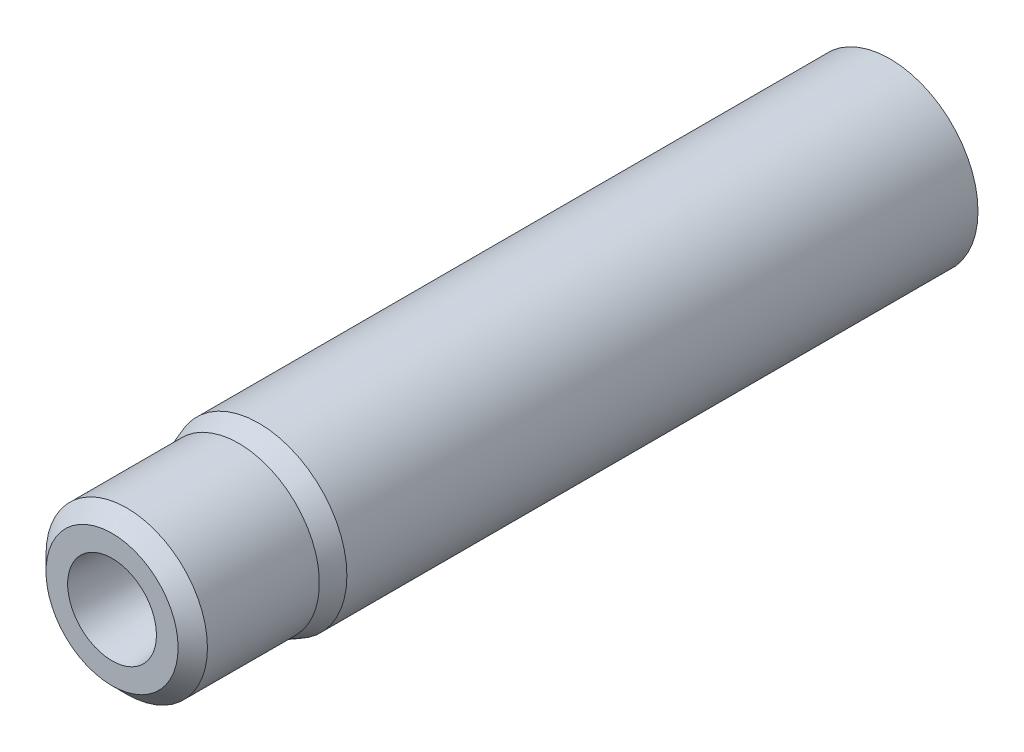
ISO-10303-21;
HEADER;
FILE_DESCRIPTION(('STEP AP214'),'2;1');
FILE_NAME('part.step','',(''),(''),'','','');
FILE_SCHEMA(('AUTOMOTIVE_DESIGN { 1 0 10303 214 1 1 1 1 }'));
ENDSEC;
DATA;
#1=APPLICATION_CONTEXT('core data for automotive mechanical design processes');
#2=APPLICATION_PROTOCOL_DEFINITION('international standard','automotive_design',2000,#1);
#3=PRODUCT_CONTEXT('',#1,'mechanical');
#4=PRODUCT('Part','Part','',(#3));
#5=PRODUCT_RELATED_PRODUCT_CATEGORY('part','',(#4));
#6=PRODUCT_DEFINITION_FORMATION('','',#4);
#7=PRODUCT_DEFINITION_CONTEXT('part definition',#1,'design');
#8=PRODUCT_DEFINITION('design','',#6,#7);
#9=PRODUCT_DEFINITION_SHAPE('','',#8);
#10=(LENGTH_UNIT() NAMED_UNIT(*) SI_UNIT(.MILLI.,.METRE.));
#11=(NAMED_UNIT(*) PLANE_ANGLE_UNIT() SI_UNIT($,.RADIAN.));
#12=(NAMED_UNIT(*) SI_UNIT($,.STERADIAN.) SOLID_ANGLE_UNIT());
#13=UNCERTAINTY_MEASURE_WITH_UNIT(LENGTH_MEASURE(1.E-05),#10,'distance_accuracy_value','');
#14=(GEOMETRIC_REPRESENTATION_CONTEXT(3) GLOBAL_UNCERTAINTY_ASSIGNED_CONTEXT((#13)) GLOBAL_UNIT_ASSIGNED_CONTEXT((#10,
#11,#12)) REPRESENTATION_CONTEXT('',''));
#15=CARTESIAN_POINT('',(0.,0.,0.));
#16=DIRECTION('',(0.,0.,1.));
#17=DIRECTION('',(1.,0.,0.));
#18=AXIS2_PLACEMENT_3D('',#15,#16,#17);
#19=CARTESIAN_POINT('',(0.,0.,45.));
#20=DIRECTION('',(0.,0.,-1.));
#21=DIRECTION('',(-1.,0.,0.));
#22=AXIS2_PLACEMENT_3D('',#19,#20,#21);
#23=CYLINDRICAL_SURFACE('',#22,6.);
#24=CARTESIAN_POINT('',(0.,0.,43.));
#25=DIRECTION('',(0.,0.,1.));
#26=DIRECTION('',(1.,0.,0.));
#27=AXIS2_PLACEMENT_3D('',#24,#25,#26);
#28=CIRCLE('',#27,6.);
#29=CARTESIAN_POINT('',(-6.,0.,43.));
#30=VERTEX_POINT('',#29);
#31=EDGE_CURVE('E57',#30,#30,#28,.F.);
#32=CARTESIAN_POINT('',(0.,0.,0.));
#33=DIRECTION('',(0.,0.,1.));
#34=DIRECTION('',(1.,0.,0.));
#35=AXIS2_PLACEMENT_3D('',#32,#33,#34);
#36=CIRCLE('',#35,6.);
#37=CARTESIAN_POINT('',(-6.,0.,0.));
#38=VERTEX_POINT('',#37);
#39=EDGE_CURVE('E53',#38,#38,#36,.T.);
#40=CARTESIAN_POINT('',(-6.,0.,43.));
#41=CARTESIAN_POINT('',(-6.,0.,42.5520833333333));
#42=CARTESIAN_POINT('',(-6.,0.,42.1041666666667));
#43=CARTESIAN_POINT('',(-6.,0.,41.2083333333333));
#44=CARTESIAN_POINT('',(-6.,0.,40.7604166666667));
#45=CARTESIAN_POINT('',(-6.,0.,39.8645833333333));
#46=CARTESIAN_POINT('',(-6.,0.,39.4166666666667));
#47=CARTESIAN_POINT('',(-6.,0.,38.5208333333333));
#48=CARTESIAN_POINT('',(-6.,0.,38.0729166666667));
#49=CARTESIAN_POINT('',(-6.,0.,37.1770833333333));
#50=CARTESIAN_POINT('',(-6.,0.,36.7291666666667));
#51=CARTESIAN_POINT('',(-6.,0.,35.8333333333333));
#52=CARTESIAN_POINT('',(-6.,0.,35.3854166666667));
#53=CARTESIAN_POINT('',(-6.,0.,34.4895833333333));
#54=CARTESIAN_POINT('',(-6.,0.,34.0416666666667));
#55=CARTESIAN_POINT('',(-6.,0.,33.1458333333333));
#56=CARTESIAN_POINT('',(-6.,0.,32.6979166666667));
#57=CARTESIAN_POINT('',(-6.,0.,31.8020833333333));
#58=CARTESIAN_POINT('',(-6.,0.,31.3541666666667));
#59=CARTESIAN_POINT('',(-6.,0.,30.4583333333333));
#60=CARTESIAN_POINT('',(-6.,0.,30.0104166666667));
#61=CARTESIAN_POINT('',(-6.,0.,29.1145833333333));
#62=CARTESIAN_POINT('',(-6.,0.,28.6666666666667));
#63=CARTESIAN_POINT('',(-6.,0.,27.7708333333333));
#64=CARTESIAN_POINT('',(-6.,0.,27.3229166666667));
#65=CARTESIAN_POINT('',(-6.,0.,26.4270833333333));
#66=CARTESIAN_POINT('',(-6.,0.,25.9791666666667));
#67=CARTESIAN_POINT('',(-6.,0.,25.0833333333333));
#68=CARTESIAN_POINT('',(-6.,0.,24.6354166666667));
#69=CARTESIAN_POINT('',(-6.,0.,23.7395833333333));
#70=CARTESIAN_POINT('',(-6.,0.,23.2916666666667));
#71=CARTESIAN_POINT('',(-6.,0.,22.3958333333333));
#72=CARTESIAN_POINT('',(-6.,0.,21.9479166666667));
#73=CARTESIAN_POINT('',(-6.,0.,21.0520833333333));
#74=CARTESIAN_POINT('',(-6.,0.,20.6041666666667));
#75=CARTESIAN_POINT('',(-6.,0.,19.7083333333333));
#76=CARTESIAN_POINT('',(-6.,0.,19.2604166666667));
#77=CARTESIAN_POINT('',(-6.,0.,18.3645833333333));
#78=CARTESIAN_POINT('',(-6.,0.,17.9166666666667));
#79=CARTESIAN_POINT('',(-6.,0.,17.0208333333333));
#80=CARTESIAN_POINT('',(-6.,0.,16.5729166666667));
#81=CARTESIAN_POINT('',(-6.,0.,15.6770833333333));
#82=CARTESIAN_POINT('',(-6.,0.,15.2291666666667));
#83=CARTESIAN_POINT('',(-6.,0.,14.3333333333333));
#84=CARTESIAN_POINT('',(-6.,0.,13.8854166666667));
#85=CARTESIAN_POINT('',(-6.,0.,12.9895833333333));
#86=CARTESIAN_POINT('',(-6.,0.,12.5416666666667));
#87=CARTESIAN_POINT('',(-6.,0.,11.6458333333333));
#88=CARTESIAN_POINT('',(-6.,0.,11.1979166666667));
#89=CARTESIAN_POINT('',(-6.,0.,10.3020833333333));
#90=CARTESIAN_POINT('',(-6.,0.,9.85416666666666));
#91=CARTESIAN_POINT('',(-6.,0.,8.95833333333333));
#92=CARTESIAN_POINT('',(-6.,0.,8.51041666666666));
#93=CARTESIAN_POINT('',(-6.,0.,7.61458333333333));
#94=CARTESIAN_POINT('',(-6.,0.,7.16666666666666));
#95=CARTESIAN_POINT('',(-6.,0.,6.27083333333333));
#96=CARTESIAN_POINT('',(-6.,0.,5.82291666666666));
#97=CARTESIAN_POINT('',(-6.,0.,4.92708333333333));
#98=CARTESIAN_POINT('',(-6.,0.,4.47916666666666));
#99=CARTESIAN_POINT('',(-6.,0.,3.58333333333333));
#100=CARTESIAN_POINT('',(-6.,0.,3.13541666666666));
#101=CARTESIAN_POINT('',(-6.,0.,2.23958333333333));
#102=CARTESIAN_POINT('',(-6.,0.,1.79166666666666));
#103=CARTESIAN_POINT('',(-6.,0.,0.895833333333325));
#104=CARTESIAN_POINT('',(-6.,0.,0.447916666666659));
#105=CARTESIAN_POINT('',(-6.,0.,0.));
#106=B_SPLINE_CURVE_WITH_KNOTS('',3,(#40,#41,#42,#43,#44,#45,#46,#47,#48,#49,#50,#51,#52,#53,
#54,#55,#56,#57,#58,#59,#60,#61,#62,#63,#64,#65,#66,#67,#68,#69,#70,#71,#72,#73,#74,#75,#76,#77,
#78,#79,#80,#81,#82,#83,#84,#85,#86,#87,#88,#89,#90,#91,#92,#93,#94,#95,#96,#97,#98,#99,#100,
#101,#102,#103,#104,#105),.UNSPECIFIED.,.F.,.F.,(4,2,2,2,2,2,2,2,2,2,2,2,2,2,2,2,2,2,2,2,2,2,2,
2,2,2,2,2,2,2,2,2,4),(0.,1.34375,2.6875,4.03124999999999,5.375,6.71875,8.06249999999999,9.40625,
10.75,12.09375,13.4375,14.78125,16.125,17.46875,18.8125,20.15625,21.5,22.84375,24.1875,25.53125,
26.875,28.21875,29.5625,30.90625,32.25,33.59375,34.9375,36.28125,37.625,38.96875,40.3125,
41.65625,43.),.UNSPECIFIED.);
#107=EDGE_CURVE('BSEAM33',#30,#38,#106,.T.);
#108=ORIENTED_EDGE('',*,*,#31,.T.);
#109=ORIENTED_EDGE('',*,*,#39,.T.);
#110=ORIENTED_EDGE('',*,*,#107,.T.);
#111=ORIENTED_EDGE('',*,*,#107,.F.);
#112=EDGE_LOOP('',(#108,#110,#109,#111));
#113=FACE_BOUND('',#112,.T.);
#114=ADVANCED_FACE('F33',(#113),#23,.T.);
#115=CARTESIAN_POINT('',(0.,0.,0.));
#116=DIRECTION('',(0.,0.,1.));
#117=DIRECTION('',(1.,0.,0.));
#118=AXIS2_PLACEMENT_3D('',#115,#116,#117);
#119=PLANE('',#118);
#120=ORIENTED_EDGE('',*,*,#39,.F.);
#121=EDGE_LOOP('',(#120));
#122=FACE_BOUND('',#121,.T.);
#123=ADVANCED_FACE('F83',(#122),#119,.F.);
#124=CARTESIAN_POINT('',(0.,0.,53.));
#125=DIRECTION('',(0.,0.,-1.));
#126=DIRECTION('',(-1.,0.,0.));
#127=AXIS2_PLACEMENT_3D('',#124,#125,#126);
#128=CYLINDRICAL_SURFACE('',#127,5.5);
#129=CARTESIAN_POINT('',(0.,0.,52.));
#130=DIRECTION('',(0.,0.,1.));
#131=DIRECTION('',(1.,0.,0.));
#132=AXIS2_PLACEMENT_3D('',#129,#130,#131);
#133=CIRCLE('',#132,5.5);
#134=CARTESIAN_POINT('',(5.5,0.,52.));
#135=VERTEX_POINT('',#134);
#136=EDGE_CURVE('E11',#135,#135,#133,.F.);
#137=ORIENTED_EDGE('',*,*,#136,.T.);
#138=EDGE_LOOP('',(#137));
#139=FACE_BOUND('',#138,.T.);
#140=CARTESIAN_POINT('',(0.,0.,44.3737387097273));
#141=DIRECTION('',(0.,0.,-1.));
#142=DIRECTION('',(-1.,0.,0.));
#143=AXIS2_PLACEMENT_3D('',#140,#141,#142);
#144=CIRCLE('',#143,5.5);
#145=CARTESIAN_POINT('',(-5.5,0.,44.3737387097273));
#146=VERTEX_POINT('',#145);
#147=EDGE_CURVE('E66',#146,#146,#144,.F.);
#148=ORIENTED_EDGE('',*,*,#147,.T.);
#149=EDGE_LOOP('',(#148));
#150=FACE_BOUND('',#149,.T.);
#151=ADVANCED_FACE('F89',(#139,#150),#128,.T.);
#152=CARTESIAN_POINT('',(0.,0.,53.));
#153=DIRECTION('',(0.,0.,1.));
#154=DIRECTION('',(1.,0.,0.));
#155=AXIS2_PLACEMENT_3D('',#152,#153,#154);
#156=PLANE('',#155);
#157=CARTESIAN_POINT('',(0.,0.,53.));
#158=DIRECTION('',(0.,0.,1.));
#159=DIRECTION('',(1.,0.,0.));
#160=AXIS2_PLACEMENT_3D('',#157,#158,#159);
#161=CIRCLE('',#160,4.5);
#162=CARTESIAN_POINT('',(4.5,0.,53.));
#163=VERTEX_POINT('',#162);
#164=EDGE_CURVE('E40',#163,#163,#161,.T.);
#165=ORIENTED_EDGE('',*,*,#164,.T.);
#166=EDGE_LOOP('',(#165));
#167=FACE_BOUND('',#166,.T.);
#168=CARTESIAN_POINT('',(0.,0.,53.));
#169=DIRECTION('',(0.,0.,1.));
#170=DIRECTION('',(1.,0.,0.));
#171=AXIS2_PLACEMENT_3D('',#168,#169,#170);
#172=CIRCLE('',#171,3.025);
#173=CARTESIAN_POINT('',(3.025,0.,53.));
#174=VERTEX_POINT('',#173);
#175=EDGE_CURVE('E60',#174,#174,#172,.T.);
#176=ORIENTED_EDGE('',*,*,#175,.F.);
#177=EDGE_LOOP('',(#176));
#178=FACE_BOUND('',#177,.T.);
#179=ADVANCED_FACE('F47',(#167,#178),#156,.T.);
#180=CARTESIAN_POINT('',(0.,0.,38.));
#181=DIRECTION('',(0.,0.,1.));
#182=DIRECTION('',(1.,0.,0.));
#183=AXIS2_PLACEMENT_3D('',#180,#181,#182);
#184=CONICAL_SURFACE('',#183,2.5,1.02974425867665);
#185=CARTESIAN_POINT('',(0.,0.,36.4978484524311));
#186=VERTEX_POINT('',#185);
#187=VERTEX_LOOP('',#186);
#188=FACE_BOUND('',#187,.T.);
#189=CARTESIAN_POINT('',(0.,0.,38.));
#190=DIRECTION('',(0.,0.,1.));
#191=DIRECTION('',(1.,0.,0.));
#192=AXIS2_PLACEMENT_3D('',#189,#190,#191);
#193=CIRCLE('',#192,2.5);
#194=CARTESIAN_POINT('',(2.5,0.,38.));
#195=VERTEX_POINT('',#194);
#196=EDGE_CURVE('E51',#195,#195,#193,.T.);
#197=ORIENTED_EDGE('',*,*,#196,.T.);
#198=EDGE_LOOP('',(#197));
#199=FACE_BOUND('',#198,.T.);
#200=ADVANCED_FACE('F43',(#188,#199),#184,.F.);
#201=CARTESIAN_POINT('',(0.,0.,53.));
#202=DIRECTION('',(0.,0.,1.));
#203=DIRECTION('',(1.,0.,0.));
#204=AXIS2_PLACEMENT_3D('',#201,#202,#203);
#205=CYLINDRICAL_SURFACE('',#204,2.5);
#206=ORIENTED_EDGE('',*,*,#196,.F.);
#207=EDGE_LOOP('',(#206));
#208=FACE_BOUND('',#207,.T.);
#209=CARTESIAN_POINT('',(0.,0.,48.0049586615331));
#210=DIRECTION('',(0.,0.,1.));
#211=DIRECTION('',(1.,0.,0.));
#212=AXIS2_PLACEMENT_3D('',#209,#210,#211);
#213=CIRCLE('',#212,2.5);
#214=CARTESIAN_POINT('',(2.5,0.,48.0049586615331));
#215=VERTEX_POINT('',#214);
#216=EDGE_CURVE('E54',#215,#215,#213,.T.);
#217=ORIENTED_EDGE('',*,*,#216,.T.);
#218=EDGE_LOOP('',(#217));
#219=FACE_BOUND('',#218,.T.);
#220=ADVANCED_FACE('F46',(#208,#219),#205,.F.);
#221=CARTESIAN_POINT('',(0.,0.,53.));
#222=DIRECTION('',(0.,0.,1.));
#223=DIRECTION('',(1.,0.,0.));
#224=AXIS2_PLACEMENT_3D('',#221,#222,#223);
#225=CONICAL_SURFACE('',#224,3.025,0.10471975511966);
#226=ORIENTED_EDGE('',*,*,#216,.F.);
#227=EDGE_LOOP('',(#226));
#228=FACE_BOUND('',#227,.T.);
#229=ORIENTED_EDGE('',*,*,#175,.T.);
#230=EDGE_LOOP('',(#229));
#231=FACE_BOUND('',#230,.T.);
#232=ADVANCED_FACE('F79',(#228,#231),#225,.F.);
#233=CARTESIAN_POINT('',(0.,0.,45.));
#234=DIRECTION('',(0.,0.,-1.));
#235=DIRECTION('',(-1.,0.,0.));
#236=AXIS2_PLACEMENT_3D('',#233,#234,#235);
#237=CONICAL_SURFACE('',#236,5.27205953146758,0.349065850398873);
#238=ORIENTED_EDGE('',*,*,#31,.F.);
#239=EDGE_LOOP('',(#238));
#240=FACE_BOUND('',#239,.T.);
#241=ORIENTED_EDGE('',*,*,#147,.F.);
#242=EDGE_LOOP('',(#241));
#243=FACE_BOUND('',#242,.T.);
#244=ADVANCED_FACE('F74',(#240,#243),#237,.T.);
#245=CARTESIAN_POINT('',(0.,0.,53.));
#246=DIRECTION('',(0.,0.,-1.));
#247=DIRECTION('',(-1.,0.,0.));
#248=AXIS2_PLACEMENT_3D('',#245,#246,#247);
#249=CONICAL_SURFACE('',#248,4.5,0.785398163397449);
#250=ORIENTED_EDGE('',*,*,#136,.F.);
#251=EDGE_LOOP('',(#250));
#252=FACE_BOUND('',#251,.T.);
#253=ORIENTED_EDGE('',*,*,#164,.F.);
#254=EDGE_LOOP('',(#253));
#255=FACE_BOUND('',#254,.T.);
#256=ADVANCED_FACE('F35',(#252,#255),#249,.T.);
#257=CLOSED_SHELL('',(#114,#123,#151,#179,#200,#220,#232,#244,#256));
#258=MANIFOLD_SOLID_BREP('B2',#257);
#259=ADVANCED_BREP_SHAPE_REPRESENTATION('',(#18,#258),#14);
#260=SHAPE_DEFINITION_REPRESENTATION(#9,#259);
ENDSEC;
END-ISO-10303-21;
